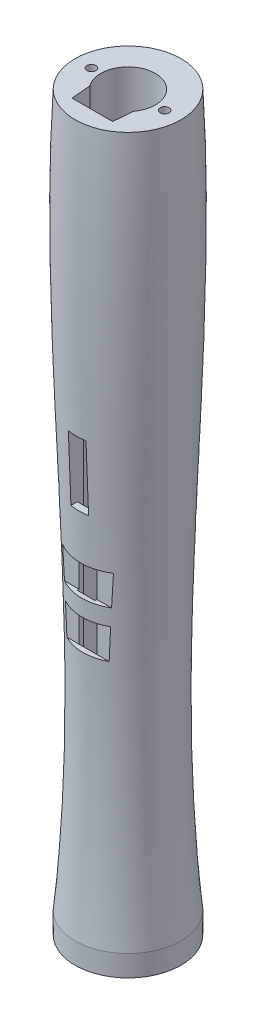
ISO-10303-21;
HEADER;
FILE_DESCRIPTION(('STEP AP214'),'2;1');
FILE_NAME('part.step','',(''),(''),'','','');
FILE_SCHEMA(('AUTOMOTIVE_DESIGN { 1 0 10303 214 1 1 1 1 }'));
ENDSEC;
DATA;
#1=APPLICATION_CONTEXT('core data for automotive mechanical design processes');
#2=APPLICATION_PROTOCOL_DEFINITION('international standard','automotive_design',2000,#1);
#3=PRODUCT_CONTEXT('',#1,'mechanical');
#4=PRODUCT('Part','Part','',(#3));
#5=PRODUCT_RELATED_PRODUCT_CATEGORY('part','',(#4));
#6=PRODUCT_DEFINITION_FORMATION('','',#4);
#7=PRODUCT_DEFINITION_CONTEXT('part definition',#1,'design');
#8=PRODUCT_DEFINITION('design','',#6,#7);
#9=PRODUCT_DEFINITION_SHAPE('','',#8);
#10=(LENGTH_UNIT() NAMED_UNIT(*) SI_UNIT(.MILLI.,.METRE.));
#11=(NAMED_UNIT(*) PLANE_ANGLE_UNIT() SI_UNIT($,.RADIAN.));
#12=(NAMED_UNIT(*) SI_UNIT($,.STERADIAN.) SOLID_ANGLE_UNIT());
#13=UNCERTAINTY_MEASURE_WITH_UNIT(LENGTH_MEASURE(1.E-05),#10,'distance_accuracy_value','');
#14=(GEOMETRIC_REPRESENTATION_CONTEXT(3) GLOBAL_UNCERTAINTY_ASSIGNED_CONTEXT((#13)) GLOBAL_UNIT_ASSIGNED_CONTEXT((#10,
#11,#12)) REPRESENTATION_CONTEXT('',''));
#15=CARTESIAN_POINT('',(0.,0.,0.));
#16=DIRECTION('',(0.,0.,1.));
#17=DIRECTION('',(1.,0.,0.));
#18=AXIS2_PLACEMENT_3D('',#15,#16,#17);
#19=CARTESIAN_POINT('',(0.,204.85,0.));
#20=DIRECTION('',(0.,-1.,0.));
#21=DIRECTION('',(0.,0.,-1.));
#22=AXIS2_PLACEMENT_3D('',#19,#20,#21);
#23=PLANE('',#22);
#24=CARTESIAN_POINT('',(-10.541,204.85,0.));
#25=DIRECTION('',(0.,1.,0.));
#26=DIRECTION('',(0.,0.,1.));
#27=AXIS2_PLACEMENT_3D('',#24,#25,#26);
#28=CIRCLE('',#27,1.28904999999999);
#29=CARTESIAN_POINT('',(-10.541,204.85,1.28904999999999));
#30=VERTEX_POINT('',#29);
#31=EDGE_CURVE('E209',#30,#30,#28,.T.);
#32=ORIENTED_EDGE('',*,*,#31,.F.);
#33=EDGE_LOOP('',(#32));
#34=FACE_BOUND('',#33,.T.);
#35=DIRECTION('',(-0.0861124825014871,0.,-0.996285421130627));
#36=VECTOR('',#35,1.);
#37=CARTESIAN_POINT('',(-6.731,204.85,0.));
#38=LINE('',#37,#36);
#39=CARTESIAN_POINT('',(-5.842,204.85,10.2853583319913));
#40=VERTEX_POINT('',#39);
#41=CARTESIAN_POINT('',(-6.32572865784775,204.85,4.68881999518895));
#42=VERTEX_POINT('',#41);
#43=EDGE_CURVE('E456',#40,#42,#38,.T.);
#44=ORIENTED_EDGE('',*,*,#43,.T.);
#45=CARTESIAN_POINT('',(0.,204.85,0.));
#46=DIRECTION('',(0.,1.,0.));
#47=DIRECTION('',(0.,0.,1.));
#48=AXIS2_PLACEMENT_3D('',#45,#46,#47);
#49=CIRCLE('',#48,7.874);
#50=CARTESIAN_POINT('',(6.32572865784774,204.85,4.68881999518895));
#51=VERTEX_POINT('',#50);
#52=EDGE_CURVE('E438',#51,#42,#49,.T.);
#53=ORIENTED_EDGE('',*,*,#52,.F.);
#54=DIRECTION('',(-0.0861124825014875,0.,0.996285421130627));
#55=VECTOR('',#54,1.);
#56=CARTESIAN_POINT('',(5.842,204.85,10.2853583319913));
#57=LINE('',#56,#55);
#58=CARTESIAN_POINT('',(5.842,204.85,10.2853583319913));
#59=VERTEX_POINT('',#58);
#60=EDGE_CURVE('E450',#51,#59,#57,.T.);
#61=ORIENTED_EDGE('',*,*,#60,.T.);
#62=DIRECTION('',(-1.,0.,0.));
#63=VECTOR('',#62,1.);
#64=CARTESIAN_POINT('',(-5.842,204.85,10.2853583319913));
#65=LINE('',#64,#63);
#66=EDGE_CURVE('E452',#59,#40,#65,.T.);
#67=ORIENTED_EDGE('',*,*,#66,.T.);
#68=EDGE_LOOP('',(#44,#53,#61,#67));
#69=FACE_BOUND('',#68,.T.);
#70=CARTESIAN_POINT('',(0.,204.85,0.));
#71=DIRECTION('',(0.,-1.,0.));
#72=DIRECTION('',(0.,0.,-1.));
#73=AXIS2_PLACEMENT_3D('',#70,#71,#72);
#74=CIRCLE('',#73,15.25);
#75=CARTESIAN_POINT('',(0.,204.85,-15.25));
#76=VERTEX_POINT('',#75);
#77=EDGE_CURVE('E474',#76,#76,#74,.T.);
#78=ORIENTED_EDGE('',*,*,#77,.F.);
#79=EDGE_LOOP('',(#78));
#80=FACE_BOUND('',#79,.T.);
#81=CARTESIAN_POINT('',(10.541,204.85,0.));
#82=DIRECTION('',(0.,1.,0.));
#83=DIRECTION('',(0.,0.,1.));
#84=AXIS2_PLACEMENT_3D('',#81,#82,#83);
#85=CIRCLE('',#84,1.28904999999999);
#86=CARTESIAN_POINT('',(10.541,204.85,1.28904999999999));
#87=VERTEX_POINT('',#86);
#88=EDGE_CURVE('E210',#87,#87,#85,.T.);
#89=ORIENTED_EDGE('',*,*,#88,.F.);
#90=EDGE_LOOP('',(#89));
#91=FACE_BOUND('',#90,.T.);
#92=ADVANCED_FACE('F34',(#34,#69,#80,#91),#23,.F.);
#93=CARTESIAN_POINT('',(-15.25,204.85,0.));
#94=CARTESIAN_POINT('',(-18.6607569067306,136.652495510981,0.));
#95=CARTESIAN_POINT('',(-8.44521283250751,68.0931069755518,0.));
#96=CARTESIAN_POINT('',(-15.25,0.,0.));
#97=B_SPLINE_CURVE_WITH_KNOTS('',3,(#93,#94,#95,#96),.UNSPECIFIED.,.F.,.F.,(4,4),(0.,1.),.UNSPECIFIED.);
#98=CARTESIAN_POINT('',(0.,0.,0.));
#99=DIRECTION('',(0.,-1.,0.));
#100=AXIS1_PLACEMENT('',#98,#99);
#101=SURFACE_OF_REVOLUTION('',#97,#100);
#102=CARTESIAN_POINT('',(0.,125.7,0.));
#103=DIRECTION('',(0.,-1.,0.));
#104=DIRECTION('',(0.,0.,-1.));
#105=AXIS2_PLACEMENT_3D('',#102,#103,#104);
#106=CIRCLE('',#105,14.8690766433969);
#107=CARTESIAN_POINT('',(-2.538,125.7,14.6508701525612));
#108=VERTEX_POINT('',#107);
#109=CARTESIAN_POINT('',(2.542,125.7,14.6501766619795));
#110=VERTEX_POINT('',#109);
#111=EDGE_CURVE('E407',#108,#110,#106,.F.);
#112=ORIENTED_EDGE('',*,*,#111,.T.);
#113=CARTESIAN_POINT('',(2.54200000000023,125.7,14.6501766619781));
#114=CARTESIAN_POINT('',(2.54200000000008,124.116594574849,14.5903733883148));
#115=CARTESIAN_POINT('',(2.54200000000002,122.533226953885,14.5295881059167));
#116=CARTESIAN_POINT('',(2.54199999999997,119.366538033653,14.4068231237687));
#117=CARTESIAN_POINT('',(2.54199999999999,117.783216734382,14.3448434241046));
#118=CARTESIAN_POINT('',(2.542,114.61659004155,14.2204591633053));
#119=CARTESIAN_POINT('',(2.542,113.033284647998,14.1580546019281));
#120=CARTESIAN_POINT('',(2.542,109.866660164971,14.0335917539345));
#121=CARTESIAN_POINT('',(2.54199999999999,108.283341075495,13.971533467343));
#122=CARTESIAN_POINT('',(2.542,106.7,13.9100338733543));
#123=B_SPLINE_CURVE_WITH_KNOTS('',3,(#113,#114,#115,#116,#117,#118,#119,#120,#121,#122),
.UNSPECIFIED.,.F.,.F.,(4,2,2,2,4),(0.,4.7536018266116,9.50720331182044,14.2608075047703,
19.0144120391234),.UNSPECIFIED.);
#124=CARTESIAN_POINT('',(2.542,106.7,13.9100338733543));
#125=VERTEX_POINT('',#124);
#126=EDGE_CURVE('E424',#110,#125,#123,.T.);
#127=ORIENTED_EDGE('',*,*,#126,.T.);
#128=CARTESIAN_POINT('',(0.,106.7,0.));
#129=DIRECTION('',(0.,-1.,0.));
#130=DIRECTION('',(0.,0.,-1.));
#131=AXIS2_PLACEMENT_3D('',#128,#129,#130);
#132=CIRCLE('',#131,14.14039625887);
#133=CARTESIAN_POINT('',(-2.538,106.7,13.9107642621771));
#134=VERTEX_POINT('',#133);
#135=EDGE_CURVE('E387',#125,#134,#132,.T.);
#136=ORIENTED_EDGE('',*,*,#135,.T.);
#137=CARTESIAN_POINT('',(-2.538,106.7,13.9107642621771));
#138=CARTESIAN_POINT('',(-2.538,108.283340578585,13.9722606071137));
#139=CARTESIAN_POINT('',(-2.538,109.866659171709,14.0343156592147));
#140=CARTESIAN_POINT('',(-2.538,113.033282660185,14.1587721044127));
#141=CARTESIAN_POINT('',(-2.538,114.616587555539,14.2211734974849));
#142=CARTESIAN_POINT('',(-2.538,117.783214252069,14.3455515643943));
#143=CARTESIAN_POINT('',(-2.538,119.366536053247,14.4075282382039));
#144=CARTESIAN_POINT('',(-2.538,122.533225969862,14.5302873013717));
#145=CARTESIAN_POINT('',(-2.538,124.116594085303,14.5910696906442));
#146=CARTESIAN_POINT('',(-2.538,125.7,14.6508701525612));
#147=B_SPLINE_CURVE_WITH_KNOTS('',3,(#137,#138,#139,#140,#141,#142,#143,#144,#145,#146),
.UNSPECIFIED.,.F.,.F.,(4,2,2,2,4),(0.,4.75360266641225,9.50720499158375,14.2608076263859,
19.0144106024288),.UNSPECIFIED.);
#148=EDGE_CURVE('E400',#134,#108,#147,.T.);
#149=ORIENTED_EDGE('',*,*,#148,.T.);
#150=EDGE_LOOP('',(#112,#127,#136,#149));
#151=FACE_BOUND('',#150,.T.);
#152=CARTESIAN_POINT('',(0.,0.,0.));
#153=DIRECTION('',(0.,1.,0.));
#154=DIRECTION('',(0.,0.,-1.));
#155=AXIS2_PLACEMENT_3D('',#152,#153,#154);
#156=CIRCLE('',#155,15.25);
#157=CARTESIAN_POINT('',(0.,0.,-15.25));
#158=VERTEX_POINT('',#157);
#159=EDGE_CURVE('E480',#158,#158,#156,.F.);
#160=ORIENTED_EDGE('',*,*,#159,.F.);
#161=EDGE_LOOP('',(#160));
#162=FACE_BOUND('',#161,.T.);
#163=ORIENTED_EDGE('',*,*,#77,.T.);
#164=EDGE_LOOP('',(#163));
#165=FACE_BOUND('',#164,.T.);
#166=CARTESIAN_POINT('',(0.,84.59,0.));
#167=DIRECTION('',(0.,-1.,0.));
#168=DIRECTION('',(0.,0.,-1.));
#169=AXIS2_PLACEMENT_3D('',#166,#167,#168);
#170=CIRCLE('',#169,13.3706468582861);
#171=CARTESIAN_POINT('',(6.7777173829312,84.59,11.5254823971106));
#172=VERTEX_POINT('',#171);
#173=CARTESIAN_POINT('',(-6.7777173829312,84.59,11.5254823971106));
#174=VERTEX_POINT('',#173);
#175=EDGE_CURVE('E430',#172,#174,#170,.T.);
#176=ORIENTED_EDGE('',*,*,#175,.T.);
#177=CARTESIAN_POINT('',(-7.32632067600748,93.49,11.5254823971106));
#178=CARTESIAN_POINT('',(-7.29464869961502,92.9956293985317,11.5254823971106));
#179=CARTESIAN_POINT('',(-7.26312403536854,92.5012493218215,11.5254823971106));
#180=CARTESIAN_POINT('',(-7.20041993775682,91.512468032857,11.5254823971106));
#181=CARTESIAN_POINT('',(-7.16924050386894,91.0180668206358,11.5254823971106));
#182=CARTESIAN_POINT('',(-7.10727740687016,90.0292400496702,11.5254823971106));
#183=CARTESIAN_POINT('',(-7.07649374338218,89.5348144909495,11.5254823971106));
#184=CARTESIAN_POINT('',(-7.01537536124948,88.5459354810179,11.5254823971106));
#185=CARTESIAN_POINT('',(-6.98504064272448,88.0514820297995,11.5254823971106));
#186=CARTESIAN_POINT('',(-6.92487520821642,87.0625440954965,11.5254823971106));
#187=CARTESIAN_POINT('',(-6.89504449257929,86.5680596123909,11.5254823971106));
#188=CARTESIAN_POINT('',(-6.83594498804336,85.5790561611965,11.5254823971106));
#189=CARTESIAN_POINT('',(-6.80667620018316,85.0845371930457,11.5254823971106));
#190=CARTESIAN_POINT('',(-6.77771738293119,84.59,11.5254823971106));
#191=B_SPLINE_CURVE_WITH_KNOTS('',3,(#177,#178,#179,#180,#181,#182,#183,#184,#185,#186,#187,
#188,#189,#190),.UNSPECIFIED.,.F.,.F.,(4,2,2,2,2,2,4),(0.,1.48615233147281,2.97230241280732,
4.45845107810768,5.94460013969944,7.43075022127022,8.91690304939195),.UNSPECIFIED.);
#192=CARTESIAN_POINT('',(-7.32632067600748,93.49,11.5254823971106));
#193=VERTEX_POINT('',#192);
#194=EDGE_CURVE('E288',#193,#174,#191,.T.);
#195=ORIENTED_EDGE('',*,*,#194,.F.);
#196=CARTESIAN_POINT('',(0.,93.49,0.));
#197=DIRECTION('',(0.,-1.,0.));
#198=DIRECTION('',(0.,0.,-1.));
#199=AXIS2_PLACEMENT_3D('',#196,#197,#198);
#200=CIRCLE('',#199,13.656929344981);
#201=CARTESIAN_POINT('',(7.32632067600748,93.49,11.5254823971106));
#202=VERTEX_POINT('',#201);
#203=EDGE_CURVE('E432',#193,#202,#200,.F.);
#204=ORIENTED_EDGE('',*,*,#203,.T.);
#205=CARTESIAN_POINT('',(6.77771738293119,84.59,11.5254823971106));
#206=CARTESIAN_POINT('',(6.80667620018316,85.0845371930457,11.5254823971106));
#207=CARTESIAN_POINT('',(6.83594498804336,85.5790561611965,11.5254823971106));
#208=CARTESIAN_POINT('',(6.89504449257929,86.5680596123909,11.5254823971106));
#209=CARTESIAN_POINT('',(6.92487520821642,87.0625440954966,11.5254823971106));
#210=CARTESIAN_POINT('',(6.98504064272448,88.0514820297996,11.5254823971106));
#211=CARTESIAN_POINT('',(7.01537536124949,88.5459354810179,11.5254823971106));
#212=CARTESIAN_POINT('',(7.07649374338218,89.5348144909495,11.5254823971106));
#213=CARTESIAN_POINT('',(7.10727740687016,90.0292400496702,11.5254823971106));
#214=CARTESIAN_POINT('',(7.16924050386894,91.0180668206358,11.5254823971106));
#215=CARTESIAN_POINT('',(7.20041993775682,91.512468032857,11.5254823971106));
#216=CARTESIAN_POINT('',(7.26312403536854,92.5012493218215,11.5254823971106));
#217=CARTESIAN_POINT('',(7.29464869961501,92.9956293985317,11.5254823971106));
#218=CARTESIAN_POINT('',(7.32632067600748,93.49,11.5254823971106));
#219=B_SPLINE_CURVE_WITH_KNOTS('',3,(#205,#206,#207,#208,#209,#210,#211,#212,#213,#214,#215,
#216,#217,#218),.UNSPECIFIED.,.F.,.F.,(4,2,2,2,2,2,4),(0.,1.48615282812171,2.97230290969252,
4.45845197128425,5.94460063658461,7.43075071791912,8.91690304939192),.UNSPECIFIED.);
#220=EDGE_CURVE('E293',#172,#202,#219,.T.);
#221=ORIENTED_EDGE('',*,*,#220,.F.);
#222=EDGE_LOOP('',(#176,#195,#204,#221));
#223=FACE_BOUND('',#222,.T.);
#224=CARTESIAN_POINT('',(0.,70.86,0.));
#225=DIRECTION('',(0.,-1.,0.));
#226=DIRECTION('',(0.,0.,-1.));
#227=AXIS2_PLACEMENT_3D('',#224,#225,#226);
#228=CIRCLE('',#227,13.0308951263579);
#229=CARTESIAN_POINT('',(6.08008908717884,70.86,11.5254823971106));
#230=VERTEX_POINT('',#229);
#231=CARTESIAN_POINT('',(-6.08008908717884,70.86,11.5254823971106));
#232=VERTEX_POINT('',#231);
#233=EDGE_CURVE('E434',#230,#232,#228,.T.);
#234=ORIENTED_EDGE('',*,*,#233,.T.);
#235=CARTESIAN_POINT('',(-6.50588851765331,79.76,11.5254823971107));
#236=CARTESIAN_POINT('',(-6.47930983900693,79.2656973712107,11.5254823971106));
#237=CARTESIAN_POINT('',(-6.45314593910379,78.771372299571,11.5254823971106));
#238=CARTESIAN_POINT('',(-6.40171921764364,77.7826795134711,11.5254823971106));
#239=CARTESIAN_POINT('',(-6.37645638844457,77.2883117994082,11.5254823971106));
#240=CARTESIAN_POINT('',(-6.32690299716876,76.299530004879,11.5254823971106));
#241=CARTESIAN_POINT('',(-6.30261243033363,75.8051159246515,11.5254823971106));
#242=CARTESIAN_POINT('',(-6.25507742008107,74.8162370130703,11.5254823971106));
#243=CARTESIAN_POINT('',(-6.2318329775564,74.3217721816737,11.5254823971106));
#244=CARTESIAN_POINT('',(-6.18646581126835,73.3327889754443,11.5254823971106));
#245=CARTESIAN_POINT('',(-6.16434309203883,72.8382706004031,11.5254823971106));
#246=CARTESIAN_POINT('',(-6.12129703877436,71.8491769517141,11.5254823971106));
#247=CARTESIAN_POINT('',(-6.10037371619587,71.3546016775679,11.5254823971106));
#248=CARTESIAN_POINT('',(-6.08008908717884,70.86,11.5254823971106));
#249=B_SPLINE_CURVE_WITH_KNOTS('',3,(#235,#236,#237,#238,#239,#240,#241,#242,#243,#244,#245,
#246,#247,#248),.UNSPECIFIED.,.F.,.F.,(4,2,2,2,2,2,4),(0.,1.48505007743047,2.97008755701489,
4.45511776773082,5.94014924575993,7.42518672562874,8.91023838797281),.UNSPECIFIED.);
#250=CARTESIAN_POINT('',(-6.50588851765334,79.76,11.5254823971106));
#251=VERTEX_POINT('',#250);
#252=EDGE_CURVE('E250',#251,#232,#249,.T.);
#253=ORIENTED_EDGE('',*,*,#252,.F.);
#254=CARTESIAN_POINT('',(0.,79.76,0.));
#255=DIRECTION('',(0.,-1.,0.));
#256=DIRECTION('',(0.,0.,-1.));
#257=AXIS2_PLACEMENT_3D('',#254,#255,#256);
#258=CIRCLE('',#257,13.23492840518);
#259=CARTESIAN_POINT('',(6.50588851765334,79.76,11.5254823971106));
#260=VERTEX_POINT('',#259);
#261=EDGE_CURVE('E436',#251,#260,#258,.F.);
#262=ORIENTED_EDGE('',*,*,#261,.T.);
#263=CARTESIAN_POINT('',(6.08008908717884,70.86,11.5254823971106));
#264=CARTESIAN_POINT('',(6.10037371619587,71.3546016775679,11.5254823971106));
#265=CARTESIAN_POINT('',(6.12129703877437,71.8491769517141,11.5254823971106));
#266=CARTESIAN_POINT('',(6.16434309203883,72.8382706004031,11.5254823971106));
#267=CARTESIAN_POINT('',(6.18646581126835,73.3327889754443,11.5254823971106));
#268=CARTESIAN_POINT('',(6.23183297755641,74.3217721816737,11.5254823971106));
#269=CARTESIAN_POINT('',(6.25507742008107,74.8162370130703,11.5254823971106));
#270=CARTESIAN_POINT('',(6.30261243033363,75.8051159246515,11.5254823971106));
#271=CARTESIAN_POINT('',(6.32690299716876,76.299530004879,11.5254823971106));
#272=CARTESIAN_POINT('',(6.37645638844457,77.2883117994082,11.5254823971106));
#273=CARTESIAN_POINT('',(6.40171921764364,77.7826795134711,11.5254823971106));
#274=CARTESIAN_POINT('',(6.45314593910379,78.771372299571,11.5254823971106));
#275=CARTESIAN_POINT('',(6.47930983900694,79.2656973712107,11.5254823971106));
#276=CARTESIAN_POINT('',(6.50588851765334,79.76,11.5254823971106));
#277=B_SPLINE_CURVE_WITH_KNOTS('',3,(#263,#264,#265,#266,#267,#268,#269,#270,#271,#272,#273,
#274,#275,#276),.UNSPECIFIED.,.F.,.F.,(4,2,2,2,2,2,4),(0.,1.48505166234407,2.97008914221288,
4.45512062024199,5.94015083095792,7.42518831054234,8.91023838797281),.UNSPECIFIED.);
#278=EDGE_CURVE('E258',#230,#260,#277,.T.);
#279=ORIENTED_EDGE('',*,*,#278,.F.);
#280=EDGE_LOOP('',(#234,#253,#262,#279));
#281=FACE_BOUND('',#280,.T.);
#282=ADVANCED_FACE('F263',(#151,#162,#165,#223,#281),#101,.T.);
#283=CARTESIAN_POINT('',(2.542,70.86,20.2853583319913));
#284=DIRECTION('',(1.,0.,0.));
#285=DIRECTION('',(0.,0.,-1.));
#286=AXIS2_PLACEMENT_3D('',#283,#284,#285);
#287=PLANE('',#286);
#288=DIRECTION('',(0.,-1.,0.));
#289=VECTOR('',#288,1.);
#290=CARTESIAN_POINT('',(2.542,70.86,11.5254823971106));
#291=LINE('',#290,#289);
#292=CARTESIAN_POINT('',(2.542,79.76,11.5254823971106));
#293=VERTEX_POINT('',#292);
#294=CARTESIAN_POINT('',(2.542,70.86,11.5254823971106));
#295=VERTEX_POINT('',#294);
#296=EDGE_CURVE('E248',#293,#295,#291,.T.);
#297=ORIENTED_EDGE('',*,*,#296,.F.);
#298=DIRECTION('',(0.,0.,-1.));
#299=VECTOR('',#298,1.);
#300=CARTESIAN_POINT('',(2.542,79.76,20.2853583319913));
#301=LINE('',#300,#299);
#302=CARTESIAN_POINT('',(2.542,79.76,12.0653583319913));
#303=VERTEX_POINT('',#302);
#304=EDGE_CURVE('E56',#303,#293,#301,.T.);
#305=ORIENTED_EDGE('',*,*,#304,.F.);
#306=DIRECTION('',(0.,-1.,0.));
#307=VECTOR('',#306,1.);
#308=CARTESIAN_POINT('',(2.542,114.989568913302,12.0653583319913));
#309=LINE('',#308,#307);
#310=CARTESIAN_POINT('',(2.542,84.59,12.0653583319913));
#311=VERTEX_POINT('',#310);
#312=EDGE_CURVE('E307',#311,#303,#309,.T.);
#313=ORIENTED_EDGE('',*,*,#312,.F.);
#314=DIRECTION('',(0.,0.,1.));
#315=VECTOR('',#314,1.);
#316=CARTESIAN_POINT('',(2.542,84.59,20.2853583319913));
#317=LINE('',#316,#315);
#318=CARTESIAN_POINT('',(2.542,84.59,11.5254823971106));
#319=VERTEX_POINT('',#318);
#320=EDGE_CURVE('E241',#319,#311,#317,.T.);
#321=ORIENTED_EDGE('',*,*,#320,.F.);
#322=DIRECTION('',(0.,-1.,0.));
#323=VECTOR('',#322,1.);
#324=CARTESIAN_POINT('',(2.542,70.86,11.5254823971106));
#325=LINE('',#324,#323);
#326=CARTESIAN_POINT('',(2.542,93.49,11.5254823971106));
#327=VERTEX_POINT('',#326);
#328=EDGE_CURVE('E853',#327,#319,#325,.T.);
#329=ORIENTED_EDGE('',*,*,#328,.F.);
#330=DIRECTION('',(0.,0.,-1.));
#331=VECTOR('',#330,1.);
#332=CARTESIAN_POINT('',(2.542,93.49,20.2853583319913));
#333=LINE('',#332,#331);
#334=CARTESIAN_POINT('',(2.542,93.49,12.0653583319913));
#335=VERTEX_POINT('',#334);
#336=EDGE_CURVE('E49',#335,#327,#333,.T.);
#337=ORIENTED_EDGE('',*,*,#336,.F.);
#338=CARTESIAN_POINT('',(2.542,106.7,12.0653583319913));
#339=VERTEX_POINT('',#338);
#340=EDGE_CURVE('E366',#339,#335,#309,.T.);
#341=ORIENTED_EDGE('',*,*,#340,.F.);
#342=DIRECTION('',(0.,0.,-1.));
#343=VECTOR('',#342,1.);
#344=CARTESIAN_POINT('',(2.542,106.7,20.2853583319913));
#345=LINE('',#344,#343);
#346=EDGE_CURVE('E381',#125,#339,#345,.T.);
#347=ORIENTED_EDGE('',*,*,#346,.F.);
#348=ORIENTED_EDGE('',*,*,#126,.F.);
#349=DIRECTION('',(0.,0.,-1.));
#350=VECTOR('',#349,1.);
#351=CARTESIAN_POINT('',(2.542,125.7,20.2853583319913));
#352=LINE('',#351,#350);
#353=CARTESIAN_POINT('',(2.542,125.7,11.5254823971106));
#354=VERTEX_POINT('',#353);
#355=EDGE_CURVE('E385',#110,#354,#352,.T.);
#356=ORIENTED_EDGE('',*,*,#355,.T.);
#357=DIRECTION('',(0.,-0.992546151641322,0.121869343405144));
#358=VECTOR('',#357,1.);
#359=CARTESIAN_POINT('',(2.542,105.922587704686,13.9538432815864));
#360=LINE('',#359,#358);
#361=CARTESIAN_POINT('',(2.542,135.8,10.2853583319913));
#362=VERTEX_POINT('',#361);
#363=EDGE_CURVE('E504',#354,#362,#360,.F.);
#364=ORIENTED_EDGE('',*,*,#363,.T.);
#365=DIRECTION('',(0.,-1.,0.));
#366=VECTOR('',#365,1.);
#367=CARTESIAN_POINT('',(2.542,70.86,10.2853583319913));
#368=LINE('',#367,#366);
#369=CARTESIAN_POINT('',(2.542,60.7599999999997,10.2853583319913));
#370=VERTEX_POINT('',#369);
#371=EDGE_CURVE('E382',#362,#370,#368,.T.);
#372=ORIENTED_EDGE('',*,*,#371,.T.);
#373=DIRECTION('',(0.,-0.992546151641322,-0.121869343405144));
#374=VECTOR('',#373,1.);
#375=CARTESIAN_POINT('',(2.542,71.9196028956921,11.6555852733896));
#376=LINE('',#375,#374);
#377=EDGE_CURVE('E501',#370,#295,#376,.F.);
#378=ORIENTED_EDGE('',*,*,#377,.T.);
#379=EDGE_LOOP('',(#297,#305,#313,#321,#329,#337,#341,#347,#348,#356,#364,#372,#378));
#380=FACE_BOUND('',#379,.T.);
#381=ADVANCED_FACE('F536',(#380),#287,.F.);
#382=CARTESIAN_POINT('',(-2.538,70.86,20.2853583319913));
#383=DIRECTION('',(-1.,0.,0.));
#384=DIRECTION('',(0.,0.,1.));
#385=AXIS2_PLACEMENT_3D('',#382,#383,#384);
#386=PLANE('',#385);
#387=DIRECTION('',(0.,1.,0.));
#388=VECTOR('',#387,1.);
#389=CARTESIAN_POINT('',(-2.538,70.86,11.5254823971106));
#390=LINE('',#389,#388);
#391=CARTESIAN_POINT('',(-2.538,70.86,11.5254823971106));
#392=VERTEX_POINT('',#391);
#393=CARTESIAN_POINT('',(-2.538,79.76,11.5254823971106));
#394=VERTEX_POINT('',#393);
#395=EDGE_CURVE('E245',#392,#394,#390,.T.);
#396=ORIENTED_EDGE('',*,*,#395,.F.);
#397=DIRECTION('',(0.,0.992546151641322,0.121869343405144));
#398=VECTOR('',#397,1.);
#399=CARTESIAN_POINT('',(-2.538,71.9196028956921,11.6555852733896));
#400=LINE('',#399,#398);
#401=CARTESIAN_POINT('',(-2.538,60.7599999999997,10.2853583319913));
#402=VERTEX_POINT('',#401);
#403=EDGE_CURVE('E498',#392,#402,#400,.F.);
#404=ORIENTED_EDGE('',*,*,#403,.T.);
#405=DIRECTION('',(0.,1.,0.));
#406=VECTOR('',#405,1.);
#407=CARTESIAN_POINT('',(-2.538,70.86,10.2853583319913));
#408=LINE('',#407,#406);
#409=CARTESIAN_POINT('',(-2.538,135.8,10.2853583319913));
#410=VERTEX_POINT('',#409);
#411=EDGE_CURVE('E384',#402,#410,#408,.T.);
#412=ORIENTED_EDGE('',*,*,#411,.T.);
#413=DIRECTION('',(0.,0.992546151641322,-0.121869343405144));
#414=VECTOR('',#413,1.);
#415=CARTESIAN_POINT('',(-2.538,105.922587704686,13.9538432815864));
#416=LINE('',#415,#414);
#417=CARTESIAN_POINT('',(-2.538,125.7,11.5254823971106));
#418=VERTEX_POINT('',#417);
#419=EDGE_CURVE('E42',#410,#418,#416,.F.);
#420=ORIENTED_EDGE('',*,*,#419,.T.);
#421=DIRECTION('',(0.,0.,-1.));
#422=VECTOR('',#421,1.);
#423=CARTESIAN_POINT('',(-2.538,125.7,20.2853583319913));
#424=LINE('',#423,#422);
#425=EDGE_CURVE('E390',#108,#418,#424,.T.);
#426=ORIENTED_EDGE('',*,*,#425,.F.);
#427=ORIENTED_EDGE('',*,*,#148,.F.);
#428=DIRECTION('',(0.,0.,-1.));
#429=VECTOR('',#428,1.);
#430=CARTESIAN_POINT('',(-2.538,106.7,20.2853583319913));
#431=LINE('',#430,#429);
#432=CARTESIAN_POINT('',(-2.538,106.7,12.0653583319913));
#433=VERTEX_POINT('',#432);
#434=EDGE_CURVE('E393',#134,#433,#431,.T.);
#435=ORIENTED_EDGE('',*,*,#434,.T.);
#436=DIRECTION('',(0.,1.,0.));
#437=VECTOR('',#436,1.);
#438=CARTESIAN_POINT('',(-2.538,114.989568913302,12.0653583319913));
#439=LINE('',#438,#437);
#440=CARTESIAN_POINT('',(-2.538,93.49,12.0653583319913));
#441=VERTEX_POINT('',#440);
#442=EDGE_CURVE('E367',#441,#433,#439,.T.);
#443=ORIENTED_EDGE('',*,*,#442,.F.);
#444=DIRECTION('',(0.,0.,1.));
#445=VECTOR('',#444,1.);
#446=CARTESIAN_POINT('',(-2.538,93.49,20.2853583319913));
#447=LINE('',#446,#445);
#448=CARTESIAN_POINT('',(-2.538,93.49,11.5254823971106));
#449=VERTEX_POINT('',#448);
#450=EDGE_CURVE('E236',#449,#441,#447,.T.);
#451=ORIENTED_EDGE('',*,*,#450,.F.);
#452=DIRECTION('',(0.,1.,0.));
#453=VECTOR('',#452,1.);
#454=CARTESIAN_POINT('',(-2.538,70.86,11.5254823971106));
#455=LINE('',#454,#453);
#456=CARTESIAN_POINT('',(-2.538,84.59,11.5254823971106));
#457=VERTEX_POINT('',#456);
#458=EDGE_CURVE('E11',#457,#449,#455,.T.);
#459=ORIENTED_EDGE('',*,*,#458,.F.);
#460=DIRECTION('',(0.,0.,-1.));
#461=VECTOR('',#460,1.);
#462=CARTESIAN_POINT('',(-2.538,84.59,20.2853583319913));
#463=LINE('',#462,#461);
#464=CARTESIAN_POINT('',(-2.538,84.59,12.0653583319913));
#465=VERTEX_POINT('',#464);
#466=EDGE_CURVE('E238',#465,#457,#463,.T.);
#467=ORIENTED_EDGE('',*,*,#466,.F.);
#468=CARTESIAN_POINT('',(-2.538,79.76,12.0653583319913));
#469=VERTEX_POINT('',#468);
#470=EDGE_CURVE('E369',#469,#465,#439,.T.);
#471=ORIENTED_EDGE('',*,*,#470,.F.);
#472=DIRECTION('',(0.,0.,1.));
#473=VECTOR('',#472,1.);
#474=CARTESIAN_POINT('',(-2.538,79.76,20.2853583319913));
#475=LINE('',#474,#473);
#476=EDGE_CURVE('E243',#394,#469,#475,.T.);
#477=ORIENTED_EDGE('',*,*,#476,.F.);
#478=EDGE_LOOP('',(#396,#404,#412,#420,#426,#427,#435,#443,#451,#459,#467,#471,#477));
#479=FACE_BOUND('',#478,.T.);
#480=ADVANCED_FACE('F418',(#479),#386,.F.);
#481=CARTESIAN_POINT('',(2.542,106.7,20.2853583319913));
#482=DIRECTION('',(0.,-1.,0.));
#483=DIRECTION('',(0.,0.,-1.));
#484=AXIS2_PLACEMENT_3D('',#481,#482,#483);
#485=PLANE('',#484);
#486=DIRECTION('',(1.,0.,0.));
#487=VECTOR('',#486,1.);
#488=CARTESIAN_POINT('',(2.542,106.7,12.0653583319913));
#489=LINE('',#488,#487);
#490=EDGE_CURVE('E379',#433,#339,#489,.T.);
#491=ORIENTED_EDGE('',*,*,#490,.F.);
#492=ORIENTED_EDGE('',*,*,#434,.F.);
#493=ORIENTED_EDGE('',*,*,#135,.F.);
#494=ORIENTED_EDGE('',*,*,#346,.T.);
#495=EDGE_LOOP('',(#491,#492,#493,#494));
#496=FACE_BOUND('',#495,.T.);
#497=ADVANCED_FACE('F414',(#496),#485,.F.);
#498=CARTESIAN_POINT('',(2.542,93.49,20.2853583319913));
#499=DIRECTION('',(0.,1.,0.));
#500=DIRECTION('',(0.,0.,1.));
#501=AXIS2_PLACEMENT_3D('',#498,#499,#500);
#502=PLANE('',#501);
#503=DIRECTION('',(-1.,0.,0.));
#504=VECTOR('',#503,1.);
#505=CARTESIAN_POINT('',(2.542,93.49,12.0653583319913));
#506=LINE('',#505,#504);
#507=EDGE_CURVE('E376',#335,#441,#506,.T.);
#508=ORIENTED_EDGE('',*,*,#507,.F.);
#509=ORIENTED_EDGE('',*,*,#336,.T.);
#510=DIRECTION('',(1.,0.,0.));
#511=VECTOR('',#510,1.);
#512=CARTESIAN_POINT('',(-17.458,93.49,11.5254823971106));
#513=LINE('',#512,#511);
#514=EDGE_CURVE('E220',#327,#202,#513,.T.);
#515=ORIENTED_EDGE('',*,*,#514,.T.);
#516=ORIENTED_EDGE('',*,*,#203,.F.);
#517=EDGE_CURVE('E232',#193,#449,#513,.T.);
#518=ORIENTED_EDGE('',*,*,#517,.T.);
#519=ORIENTED_EDGE('',*,*,#450,.T.);
#520=EDGE_LOOP('',(#508,#509,#515,#516,#518,#519));
#521=FACE_BOUND('',#520,.T.);
#522=ADVANCED_FACE('F417',(#521),#502,.F.);
#523=CARTESIAN_POINT('',(2.542,84.59,20.2853583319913));
#524=DIRECTION('',(0.,-1.,0.));
#525=DIRECTION('',(0.,0.,-1.));
#526=AXIS2_PLACEMENT_3D('',#523,#524,#525);
#527=PLANE('',#526);
#528=DIRECTION('',(1.,0.,0.));
#529=VECTOR('',#528,1.);
#530=CARTESIAN_POINT('',(2.542,84.59,12.0653583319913));
#531=LINE('',#530,#529);
#532=EDGE_CURVE('E373',#465,#311,#531,.T.);
#533=ORIENTED_EDGE('',*,*,#532,.F.);
#534=ORIENTED_EDGE('',*,*,#466,.T.);
#535=DIRECTION('',(1.,0.,0.));
#536=VECTOR('',#535,1.);
#537=CARTESIAN_POINT('',(-17.458,84.59,11.5254823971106));
#538=LINE('',#537,#536);
#539=EDGE_CURVE('E225',#174,#457,#538,.T.);
#540=ORIENTED_EDGE('',*,*,#539,.F.);
#541=ORIENTED_EDGE('',*,*,#175,.F.);
#542=EDGE_CURVE('E233',#319,#172,#538,.T.);
#543=ORIENTED_EDGE('',*,*,#542,.F.);
#544=ORIENTED_EDGE('',*,*,#320,.T.);
#545=EDGE_LOOP('',(#533,#534,#540,#541,#543,#544));
#546=FACE_BOUND('',#545,.T.);
#547=ADVANCED_FACE('F688',(#546),#527,.F.);
#548=CARTESIAN_POINT('',(2.542,79.76,20.2853583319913));
#549=DIRECTION('',(0.,1.,0.));
#550=DIRECTION('',(0.,0.,1.));
#551=AXIS2_PLACEMENT_3D('',#548,#549,#550);
#552=PLANE('',#551);
#553=DIRECTION('',(-1.,0.,0.));
#554=VECTOR('',#553,1.);
#555=CARTESIAN_POINT('',(2.542,79.76,12.0653583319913));
#556=LINE('',#555,#554);
#557=EDGE_CURVE('E370',#303,#469,#556,.T.);
#558=ORIENTED_EDGE('',*,*,#557,.F.);
#559=ORIENTED_EDGE('',*,*,#304,.T.);
#560=DIRECTION('',(1.,0.,0.));
#561=VECTOR('',#560,1.);
#562=CARTESIAN_POINT('',(-17.458,79.76,11.5254823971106));
#563=LINE('',#562,#561);
#564=EDGE_CURVE('E221',#293,#260,#563,.T.);
#565=ORIENTED_EDGE('',*,*,#564,.T.);
#566=ORIENTED_EDGE('',*,*,#261,.F.);
#567=EDGE_CURVE('E224',#251,#394,#563,.T.);
#568=ORIENTED_EDGE('',*,*,#567,.T.);
#569=ORIENTED_EDGE('',*,*,#476,.T.);
#570=EDGE_LOOP('',(#558,#559,#565,#566,#568,#569));
#571=FACE_BOUND('',#570,.T.);
#572=ADVANCED_FACE('F527',(#571),#552,.F.);
#573=CARTESIAN_POINT('',(0.,204.85,0.));
#574=DIRECTION('',(0.,-1.,0.));
#575=DIRECTION('',(0.,0.,-1.));
#576=AXIS2_PLACEMENT_3D('',#573,#574,#575);
#577=CYLINDRICAL_SURFACE('',#576,6.731);
#578=CARTESIAN_POINT('',(0.,150.75,0.));
#579=DIRECTION('',(0.,1.,0.));
#580=DIRECTION('',(0.,0.,1.));
#581=AXIS2_PLACEMENT_3D('',#578,#579,#580);
#582=CIRCLE('',#581,6.731);
#583=CARTESIAN_POINT('',(-6.731,150.75,0.));
#584=VERTEX_POINT('',#583);
#585=CARTESIAN_POINT('',(6.731,150.75,0.));
#586=VERTEX_POINT('',#585);
#587=EDGE_CURVE('E442',#584,#586,#582,.F.);
#588=ORIENTED_EDGE('',*,*,#587,.F.);
#589=DIRECTION('',(0.,-1.,0.));
#590=VECTOR('',#589,1.);
#591=CARTESIAN_POINT('',(-6.731,204.85,0.));
#592=LINE('',#591,#590);
#593=CARTESIAN_POINT('',(-6.73024605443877,0.,0.00584624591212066));
#594=VERTEX_POINT('',#593);
#595=EDGE_CURVE('E467',#584,#594,#592,.T.);
#596=ORIENTED_EDGE('',*,*,#595,.T.);
#597=CARTESIAN_POINT('',(0.,1.11022302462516E-13,0.));
#598=DIRECTION('',(0.,-1.,0.));
#599=DIRECTION('',(-1.,0.,0.));
#600=AXIS2_PLACEMENT_3D('',#597,#598,#599);
#601=CIRCLE('',#600,6.731);
#602=CARTESIAN_POINT('',(6.7302463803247,0.,0.00584370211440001));
#603=VERTEX_POINT('',#602);
#604=EDGE_CURVE('E363',#594,#603,#601,.T.);
#605=ORIENTED_EDGE('',*,*,#604,.T.);
#606=DIRECTION('',(0.,-1.,0.));
#607=VECTOR('',#606,1.);
#608=CARTESIAN_POINT('',(6.731,204.85,0.));
#609=LINE('',#608,#607);
#610=EDGE_CURVE('E459',#586,#603,#609,.T.);
#611=ORIENTED_EDGE('',*,*,#610,.F.);
#612=EDGE_LOOP('',(#588,#596,#605,#611));
#613=FACE_BOUND('',#612,.T.);
#614=ADVANCED_FACE('F517',(#613),#577,.F.);
#615=CARTESIAN_POINT('',(-6.731,204.85,0.));
#616=DIRECTION('',(-0.996285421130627,0.,0.086112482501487));
#617=DIRECTION('',(0.0861124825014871,0.,0.996285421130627));
#618=AXIS2_PLACEMENT_3D('',#615,#616,#617);
#619=PLANE('',#618);
#620=DIRECTION('',(-0.0861124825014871,0.,-0.996285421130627));
#621=VECTOR('',#620,1.);
#622=CARTESIAN_POINT('',(-6.731,150.75,0.));
#623=LINE('',#622,#621);
#624=CARTESIAN_POINT('',(-6.32572865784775,150.75,4.68881999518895));
#625=VERTEX_POINT('',#624);
#626=EDGE_CURVE('E445',#625,#584,#623,.T.);
#627=ORIENTED_EDGE('',*,*,#626,.F.);
#628=DIRECTION('',(0.,1.,0.));
#629=VECTOR('',#628,1.);
#630=CARTESIAN_POINT('',(-6.32572865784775,150.75,4.68881999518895));
#631=LINE('',#630,#629);
#632=EDGE_CURVE('E447',#625,#42,#631,.T.);
#633=ORIENTED_EDGE('',*,*,#632,.T.);
#634=ORIENTED_EDGE('',*,*,#43,.F.);
#635=DIRECTION('',(0.,-1.,0.));
#636=VECTOR('',#635,1.);
#637=CARTESIAN_POINT('',(-5.842,204.85,10.2853583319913));
#638=LINE('',#637,#636);
#639=CARTESIAN_POINT('',(-5.842,0.,10.2853583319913));
#640=VERTEX_POINT('',#639);
#641=EDGE_CURVE('E464',#40,#640,#638,.T.);
#642=ORIENTED_EDGE('',*,*,#641,.T.);
#643=DIRECTION('',(-0.0861124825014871,0.,-0.996285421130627));
#644=VECTOR('',#643,1.);
#645=CARTESIAN_POINT('',(-6.731,0.,0.));
#646=LINE('',#645,#644);
#647=CARTESIAN_POINT('',(-6.63157097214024,0.,1.15037352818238));
#648=VERTEX_POINT('',#647);
#649=EDGE_CURVE('E453',#640,#648,#646,.T.);
#650=ORIENTED_EDGE('',*,*,#649,.T.);
#651=CARTESIAN_POINT('',(-6.63156922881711,0.,1.15037245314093));
#652=DIRECTION('',(-0.0861124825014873,0.,-0.996285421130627));
#653=VECTOR('',#652,1.);
#654=LINE('',#651,#653);
#655=EDGE_CURVE('E299',#648,#594,#654,.T.);
#656=ORIENTED_EDGE('',*,*,#655,.T.);
#657=ORIENTED_EDGE('',*,*,#595,.F.);
#658=EDGE_LOOP('',(#627,#633,#634,#642,#650,#656,#657));
#659=FACE_BOUND('',#658,.T.);
#660=ADVANCED_FACE('F526',(#659),#619,.F.);
#661=CARTESIAN_POINT('',(-5.842,204.85,10.2853583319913));
#662=DIRECTION('',(0.,0.,1.));
#663=DIRECTION('',(1.,0.,0.));
#664=AXIS2_PLACEMENT_3D('',#661,#662,#663);
#665=PLANE('',#664);
#666=ORIENTED_EDGE('',*,*,#371,.F.);
#667=DIRECTION('',(-1.,0.,0.));
#668=VECTOR('',#667,1.);
#669=CARTESIAN_POINT('',(-5.842,135.8,10.2853583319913));
#670=LINE('',#669,#668);
#671=EDGE_CURVE('E489',#362,#410,#670,.T.);
#672=ORIENTED_EDGE('',*,*,#671,.T.);
#673=ORIENTED_EDGE('',*,*,#411,.F.);
#674=DIRECTION('',(1.,0.,0.));
#675=VECTOR('',#674,1.);
#676=CARTESIAN_POINT('',(-5.842,60.7599999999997,10.2853583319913));
#677=LINE('',#676,#675);
#678=EDGE_CURVE('E492',#402,#370,#677,.T.);
#679=ORIENTED_EDGE('',*,*,#678,.T.);
#680=EDGE_LOOP('',(#666,#672,#673,#679));
#681=FACE_BOUND('',#680,.T.);
#682=DIRECTION('',(-1.,0.,0.));
#683=VECTOR('',#682,1.);
#684=CARTESIAN_POINT('',(-5.842,0.,10.2853583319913));
#685=LINE('',#684,#683);
#686=CARTESIAN_POINT('',(5.842,0.,10.2853583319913));
#687=VERTEX_POINT('',#686);
#688=EDGE_CURVE('E460',#687,#640,#685,.T.);
#689=ORIENTED_EDGE('',*,*,#688,.T.);
#690=ORIENTED_EDGE('',*,*,#641,.F.);
#691=ORIENTED_EDGE('',*,*,#66,.F.);
#692=DIRECTION('',(0.,-1.,0.));
#693=VECTOR('',#692,1.);
#694=CARTESIAN_POINT('',(5.842,204.85,10.2853583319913));
#695=LINE('',#694,#693);
#696=EDGE_CURVE('E468',#59,#687,#695,.T.);
#697=ORIENTED_EDGE('',*,*,#696,.T.);
#698=EDGE_LOOP('',(#689,#690,#691,#697));
#699=FACE_BOUND('',#698,.T.);
#700=ADVANCED_FACE('F665',(#681,#699),#665,.F.);
#701=CARTESIAN_POINT('',(5.842,204.85,10.2853583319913));
#702=DIRECTION('',(0.996285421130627,0.,0.0861124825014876));
#703=DIRECTION('',(0.0861124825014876,0.,-0.996285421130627));
#704=AXIS2_PLACEMENT_3D('',#701,#702,#703);
#705=PLANE('',#704);
#706=ORIENTED_EDGE('',*,*,#60,.F.);
#707=DIRECTION('',(0.,1.,0.));
#708=VECTOR('',#707,1.);
#709=CARTESIAN_POINT('',(6.32572865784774,150.75,4.68881999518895));
#710=LINE('',#709,#708);
#711=CARTESIAN_POINT('',(6.32572865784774,150.75,4.68881999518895));
#712=VERTEX_POINT('',#711);
#713=EDGE_CURVE('E483',#51,#712,#710,.F.);
#714=ORIENTED_EDGE('',*,*,#713,.T.);
#715=DIRECTION('',(-0.0861124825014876,0.,0.996285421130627));
#716=VECTOR('',#715,1.);
#717=CARTESIAN_POINT('',(5.842,150.75,10.2853583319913));
#718=LINE('',#717,#716);
#719=EDGE_CURVE('E481',#586,#712,#718,.T.);
#720=ORIENTED_EDGE('',*,*,#719,.F.);
#721=ORIENTED_EDGE('',*,*,#610,.T.);
#722=CARTESIAN_POINT('',(6.731,0.,0.));
#723=DIRECTION('',(-0.0861124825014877,0.,0.996285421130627));
#724=VECTOR('',#723,1.);
#725=LINE('',#722,#724);
#726=CARTESIAN_POINT('',(6.63156246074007,0.,1.15047789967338));
#727=VERTEX_POINT('',#726);
#728=EDGE_CURVE('E304',#603,#727,#725,.T.);
#729=ORIENTED_EDGE('',*,*,#728,.T.);
#730=DIRECTION('',(-0.0861124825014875,0.,0.996285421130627));
#731=VECTOR('',#730,1.);
#732=CARTESIAN_POINT('',(5.842,0.,10.2853583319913));
#733=LINE('',#732,#731);
#734=EDGE_CURVE('E463',#727,#687,#733,.T.);
#735=ORIENTED_EDGE('',*,*,#734,.T.);
#736=ORIENTED_EDGE('',*,*,#696,.F.);
#737=EDGE_LOOP('',(#706,#714,#720,#721,#729,#735,#736));
#738=FACE_BOUND('',#737,.T.);
#739=ADVANCED_FACE('F528',(#738),#705,.F.);
#740=CARTESIAN_POINT('',(0.,150.75,0.));
#741=DIRECTION('',(0.,1.,0.));
#742=DIRECTION('',(0.,0.,1.));
#743=AXIS2_PLACEMENT_3D('',#740,#741,#742);
#744=CYLINDRICAL_SURFACE('',#743,7.874);
#745=CARTESIAN_POINT('',(0.,150.75,0.));
#746=DIRECTION('',(0.,1.,0.));
#747=DIRECTION('',(0.,0.,1.));
#748=AXIS2_PLACEMENT_3D('',#745,#746,#747);
#749=CIRCLE('',#748,7.874);
#750=EDGE_CURVE('E439',#712,#625,#749,.T.);
#751=ORIENTED_EDGE('',*,*,#750,.F.);
#752=ORIENTED_EDGE('',*,*,#713,.F.);
#753=ORIENTED_EDGE('',*,*,#52,.T.);
#754=ORIENTED_EDGE('',*,*,#632,.F.);
#755=EDGE_LOOP('',(#751,#752,#753,#754));
#756=FACE_BOUND('',#755,.T.);
#757=ADVANCED_FACE('F653',(#756),#744,.F.);
#758=CARTESIAN_POINT('',(0.,150.75,0.));
#759=DIRECTION('',(0.,1.,0.));
#760=DIRECTION('',(0.,0.,1.));
#761=AXIS2_PLACEMENT_3D('',#758,#759,#760);
#762=PLANE('',#761);
#763=ORIENTED_EDGE('',*,*,#626,.T.);
#764=ORIENTED_EDGE('',*,*,#587,.T.);
#765=ORIENTED_EDGE('',*,*,#719,.T.);
#766=ORIENTED_EDGE('',*,*,#750,.T.);
#767=EDGE_LOOP('',(#763,#764,#765,#766));
#768=FACE_BOUND('',#767,.T.);
#769=ADVANCED_FACE('F422',(#768),#762,.T.);
#770=CARTESIAN_POINT('',(2.542,125.7,20.2853583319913));
#771=DIRECTION('',(0.,1.,0.));
#772=DIRECTION('',(0.,0.,1.));
#773=AXIS2_PLACEMENT_3D('',#770,#771,#772);
#774=PLANE('',#773);
#775=ORIENTED_EDGE('',*,*,#425,.T.);
#776=DIRECTION('',(1.,0.,0.));
#777=VECTOR('',#776,1.);
#778=CARTESIAN_POINT('',(2.542,125.7,11.5254823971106));
#779=LINE('',#778,#777);
#780=EDGE_CURVE('E495',#418,#354,#779,.T.);
#781=ORIENTED_EDGE('',*,*,#780,.T.);
#782=ORIENTED_EDGE('',*,*,#355,.F.);
#783=ORIENTED_EDGE('',*,*,#111,.F.);
#784=EDGE_LOOP('',(#775,#781,#782,#783));
#785=FACE_BOUND('',#784,.T.);
#786=ADVANCED_FACE('F412',(#785),#774,.F.);
#787=CARTESIAN_POINT('',(2.542,70.86,20.2853583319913));
#788=DIRECTION('',(0.,-1.,0.));
#789=DIRECTION('',(0.,0.,-1.));
#790=AXIS2_PLACEMENT_3D('',#787,#788,#789);
#791=PLANE('',#790);
#792=ORIENTED_EDGE('',*,*,#233,.F.);
#793=DIRECTION('',(1.,0.,0.));
#794=VECTOR('',#793,1.);
#795=CARTESIAN_POINT('',(-17.458,70.86,11.5254823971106));
#796=LINE('',#795,#794);
#797=EDGE_CURVE('E226',#295,#230,#796,.T.);
#798=ORIENTED_EDGE('',*,*,#797,.F.);
#799=DIRECTION('',(-1.,0.,0.));
#800=VECTOR('',#799,1.);
#801=CARTESIAN_POINT('',(2.542,70.86,11.5254823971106));
#802=LINE('',#801,#800);
#803=EDGE_CURVE('E486',#295,#392,#802,.T.);
#804=ORIENTED_EDGE('',*,*,#803,.T.);
#805=EDGE_CURVE('E229',#232,#392,#796,.T.);
#806=ORIENTED_EDGE('',*,*,#805,.F.);
#807=EDGE_LOOP('',(#792,#798,#804,#806));
#808=FACE_BOUND('',#807,.T.);
#809=ADVANCED_FACE('F633',(#808),#791,.F.);
#810=CARTESIAN_POINT('',(2.542,70.86,11.5254823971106));
#811=DIRECTION('',(0.,-0.121869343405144,0.992546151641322));
#812=DIRECTION('',(-1.,0.,0.));
#813=AXIS2_PLACEMENT_3D('',#810,#811,#812);
#814=PLANE('',#813);
#815=ORIENTED_EDGE('',*,*,#377,.F.);
#816=ORIENTED_EDGE('',*,*,#678,.F.);
#817=ORIENTED_EDGE('',*,*,#403,.F.);
#818=ORIENTED_EDGE('',*,*,#803,.F.);
#819=EDGE_LOOP('',(#815,#816,#817,#818));
#820=FACE_BOUND('',#819,.T.);
#821=ADVANCED_FACE('F625',(#820),#814,.F.);
#822=CARTESIAN_POINT('',(2.542,125.7,11.5254823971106));
#823=DIRECTION('',(0.,0.121869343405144,0.992546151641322));
#824=DIRECTION('',(1.,0.,0.));
#825=AXIS2_PLACEMENT_3D('',#822,#823,#824);
#826=PLANE('',#825);
#827=ORIENTED_EDGE('',*,*,#419,.F.);
#828=ORIENTED_EDGE('',*,*,#671,.F.);
#829=ORIENTED_EDGE('',*,*,#363,.F.);
#830=ORIENTED_EDGE('',*,*,#780,.F.);
#831=EDGE_LOOP('',(#827,#828,#829,#830));
#832=FACE_BOUND('',#831,.T.);
#833=ADVANCED_FACE('F36',(#832),#826,.F.);
#834=CARTESIAN_POINT('',(0.,0.,12.0653583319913));
#835=DIRECTION('',(0.,0.,-1.));
#836=DIRECTION('',(-1.,0.,0.));
#837=AXIS2_PLACEMENT_3D('',#834,#835,#836);
#838=PLANE('',#837);
#839=ORIENTED_EDGE('',*,*,#532,.T.);
#840=ORIENTED_EDGE('',*,*,#312,.T.);
#841=ORIENTED_EDGE('',*,*,#557,.T.);
#842=ORIENTED_EDGE('',*,*,#470,.T.);
#843=EDGE_LOOP('',(#839,#840,#841,#842));
#844=FACE_BOUND('',#843,.T.);
#845=ADVANCED_FACE('F611',(#844),#838,.T.);
#846=ORIENTED_EDGE('',*,*,#490,.T.);
#847=ORIENTED_EDGE('',*,*,#340,.T.);
#848=ORIENTED_EDGE('',*,*,#507,.T.);
#849=ORIENTED_EDGE('',*,*,#442,.T.);
#850=EDGE_LOOP('',(#846,#847,#848,#849));
#851=FACE_BOUND('',#850,.T.);
#852=ADVANCED_FACE('F324',(#851),#838,.T.);
#853=CARTESIAN_POINT('',(0.,0.,0.));
#854=DIRECTION('',(0.,-1.,0.));
#855=DIRECTION('',(0.,0.,-1.));
#856=AXIS2_PLACEMENT_3D('',#853,#854,#855);
#857=PLANE('',#856);
#858=CARTESIAN_POINT('',(6.63217146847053,0.,1.15058355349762));
#859=CARTESIAN_POINT('',(6.61555775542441,0.,1.24662494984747));
#860=CARTESIAN_POINT('',(6.59680663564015,0.,1.34229594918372));
#861=CARTESIAN_POINT('',(6.55507197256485,0.,1.53280913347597));
#862=CARTESIAN_POINT('',(6.53208428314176,0.,1.62765041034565));
#863=CARTESIAN_POINT('',(6.48187820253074,0.,1.81650328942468));
#864=CARTESIAN_POINT('',(6.4546475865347,0.,1.91051163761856));
#865=CARTESIAN_POINT('',(6.39596402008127,0.,2.09770539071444));
#866=CARTESIAN_POINT('',(6.36449119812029,0.,2.19088457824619));
#867=CARTESIAN_POINT('',(6.313285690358,0.,2.33234558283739));
#868=CARTESIAN_POINT('',(6.2949853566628,0.,2.38115097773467));
#869=CARTESIAN_POINT('',(6.25721022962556,0.,2.47853351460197));
#870=CARTESIAN_POINT('',(6.23773098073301,0.,2.52710893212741));
#871=CARTESIAN_POINT('',(6.19979002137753,0.,2.61873274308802));
#872=CARTESIAN_POINT('',(6.18143626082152,0.,2.66182588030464));
#873=CARTESIAN_POINT('',(6.14392245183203,0.,2.74747687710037));
#874=CARTESIAN_POINT('',(6.12476549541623,0.,2.79003609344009));
#875=CARTESIAN_POINT('',(6.06390622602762,0.,2.92162345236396));
#876=CARTESIAN_POINT('',(6.02071023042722,0.,3.00996702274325));
#877=CARTESIAN_POINT('',(5.93069946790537,0.,3.1842517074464));
#878=CARTESIAN_POINT('',(5.88390303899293,0.,3.27020230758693));
#879=CARTESIAN_POINT('',(5.78669743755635,0.,3.43970803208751));
#880=CARTESIAN_POINT('',(5.736299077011,0.,3.52326935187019));
#881=CARTESIAN_POINT('',(5.63189766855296,0.,3.68799880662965));
#882=CARTESIAN_POINT('',(5.57789805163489,0.,3.76916911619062));
#883=CARTESIAN_POINT('',(5.46630134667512,0.,3.92912103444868));
#884=CARTESIAN_POINT('',(5.4087006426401,0.,4.00790012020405));
#885=CARTESIAN_POINT('',(5.28990903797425,0.,4.16307433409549));
#886=CARTESIAN_POINT('',(5.22870797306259,0.,4.23946167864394));
#887=CARTESIAN_POINT('',(5.10157558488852,0.,4.39122531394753));
#888=CARTESIAN_POINT('',(5.03556760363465,0.,4.46653737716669));
#889=CARTESIAN_POINT('',(4.89984474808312,0.,4.61470348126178));
#890=CARTESIAN_POINT('',(4.83010738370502,0.,4.68753690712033));
#891=CARTESIAN_POINT('',(4.69014216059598,0.,4.82752762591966));
#892=CARTESIAN_POINT('',(4.62002437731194,0.,4.89479501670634));
#893=CARTESIAN_POINT('',(4.47744250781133,0.,5.02585242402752));
#894=CARTESIAN_POINT('',(4.40499649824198,0.,5.08966209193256));
#895=CARTESIAN_POINT('',(4.25641527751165,0.,5.21494837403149));
#896=CARTESIAN_POINT('',(4.18024324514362,0.,5.27638134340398));
#897=CARTESIAN_POINT('',(4.02547887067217,0.,5.39565086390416));
#898=CARTESIAN_POINT('',(3.94689404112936,0.,5.45349716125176));
#899=CARTESIAN_POINT('',(3.7873099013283,0.,5.56559960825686));
#900=CARTESIAN_POINT('',(3.70631283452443,0.,5.61985895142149));
#901=CARTESIAN_POINT('',(3.54190915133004,0.,5.72479425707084));
#902=CARTESIAN_POINT('',(3.45850007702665,0.,5.7754663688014));
#903=CARTESIAN_POINT('',(3.28927803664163,0.,5.87323391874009));
#904=CARTESIAN_POINT('',(3.20345859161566,0.,5.92031813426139));
#905=CARTESIAN_POINT('',(3.02941577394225,0.,6.01091898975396));
#906=CARTESIAN_POINT('',(2.94118263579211,0.,6.05441689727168));
#907=CARTESIAN_POINT('',(2.806499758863,0.,6.11724252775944));
#908=CARTESIAN_POINT('',(2.76070752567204,0.,6.1379918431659));
#909=CARTESIAN_POINT('',(2.66850085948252,0.,6.17856801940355));
#910=CARTESIAN_POINT('',(2.62208469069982,0.,6.19839094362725));
#911=CARTESIAN_POINT('',(2.53046979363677,0.,6.23634993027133));
#912=CARTESIAN_POINT('',(2.48528547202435,0.,6.25452077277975));
#913=CARTESIAN_POINT('',(2.39470960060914,0.,6.28983661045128));
#914=CARTESIAN_POINT('',(2.34931942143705,0.,6.30698512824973));
#915=CARTESIAN_POINT('',(2.21144070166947,0.,6.35740359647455));
#916=CARTESIAN_POINT('',(2.11839599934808,0.,6.38916826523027));
#917=CARTESIAN_POINT('',(1.93144656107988,0.,6.44844025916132));
#918=CARTESIAN_POINT('',(1.83754796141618,0.,6.47596698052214));
#919=CARTESIAN_POINT('',(1.64889017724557,0.,6.52677224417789));
#920=CARTESIAN_POINT('',(1.55413415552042,0.,6.55006251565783));
#921=CARTESIAN_POINT('',(1.36376553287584,0.,6.59240222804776));
#922=CARTESIAN_POINT('',(1.26815374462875,0.,6.61145532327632));
#923=CARTESIAN_POINT('',(1.07607554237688,0.,6.6453289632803));
#924=CARTESIAN_POINT('',(0.979608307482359,0.,6.66014485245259));
#925=CARTESIAN_POINT('',(0.785820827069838,0.,6.68555257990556));
#926=CARTESIAN_POINT('',(0.688498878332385,0.,6.6961314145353));
#927=CARTESIAN_POINT('',(0.493074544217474,0.,6.71306650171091));
#928=CARTESIAN_POINT('',(0.394970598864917,0.,6.71940471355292));
#929=CARTESIAN_POINT('',(0.197912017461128,0.,6.72788145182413));
#930=CARTESIAN_POINT('',(0.0989561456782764,0.,6.72999101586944));
#931=CARTESIAN_POINT('',(-0.0990011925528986,0.,6.73000898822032));
#932=CARTESIAN_POINT('',(-0.198002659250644,0.,6.72791548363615));
#933=CARTESIAN_POINT('',(-0.39517472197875,0.,6.71945053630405));
#934=CARTESIAN_POINT('',(-0.49334651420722,0.,6.71310719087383));
#935=CARTESIAN_POINT('',(-0.68878640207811,0.,6.69615880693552));
#936=CARTESIAN_POINT('',(-0.786056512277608,0.,6.68557704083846));
#937=CARTESIAN_POINT('',(-0.979765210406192,0.,6.66015935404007));
#938=CARTESIAN_POINT('',(-1.07620535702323,0.,6.64533532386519));
#939=CARTESIAN_POINT('',(-1.2682543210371,0.,6.61144166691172));
#940=CARTESIAN_POINT('',(-1.36386376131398,0.,6.59237556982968));
#941=CARTESIAN_POINT('',(-1.55425268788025,0.,6.55000604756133));
#942=CARTESIAN_POINT('',(-1.64903111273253,0.,6.52669785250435));
#943=CARTESIAN_POINT('',(-1.83775873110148,0.,6.47585288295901));
#944=CARTESIAN_POINT('',(-1.9317044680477,0.,6.44830329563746));
#945=CARTESIAN_POINT('',(-2.1187733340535,0.,6.38898188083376));
#946=CARTESIAN_POINT('',(-2.21188999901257,0.,6.35718962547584));
#947=CARTESIAN_POINT('',(-2.34974952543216,0.,6.30677965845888));
#948=CARTESIAN_POINT('',(-2.3950489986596,0.,6.28966842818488));
#949=CARTESIAN_POINT('',(-2.48545100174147,0.,6.25443298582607));
#950=CARTESIAN_POINT('',(-2.53055213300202,0.,6.23630517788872));
#951=CARTESIAN_POINT('',(-2.62217295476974,0.,6.19836543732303));
#952=CARTESIAN_POINT('',(-2.66867674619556,0.,6.17851509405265));
#953=CARTESIAN_POINT('',(-2.76106019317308,0.,6.13787428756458));
#954=CARTESIAN_POINT('',(-2.80694154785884,0.,6.11708767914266));
#955=CARTESIAN_POINT('',(-2.94164335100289,0.,6.05425429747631));
#956=CARTESIAN_POINT('',(-3.0298068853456,0.,6.01078723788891));
#957=CARTESIAN_POINT('',(-3.20373188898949,0.,5.92023482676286));
#958=CARTESIAN_POINT('',(-3.28950262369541,0.,5.8731672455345));
#959=CARTESIAN_POINT('',(-3.45864878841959,0.,5.77541994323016));
#960=CARTESIAN_POINT('',(-3.54203013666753,0.,5.72475047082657));
#961=CARTESIAN_POINT('',(-3.70639996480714,0.,5.61980738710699));
#962=CARTESIAN_POINT('',(-3.7873902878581,0.,5.56553666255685));
#963=CARTESIAN_POINT('',(-3.94698252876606,0.,5.45339833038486));
#964=CARTESIAN_POINT('',(-4.02558154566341,0.,5.39552659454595));
#965=CARTESIAN_POINT('',(-4.18039616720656,0.,5.27619326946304));
#966=CARTESIAN_POINT('',(-4.25660357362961,0.,5.21472104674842));
#967=CARTESIAN_POINT('',(-4.40516488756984,0.,5.08943666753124));
#968=CARTESIAN_POINT('',(-4.47755892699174,0.,5.02567207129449));
#969=CARTESIAN_POINT('',(-4.62006715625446,0.,4.89470492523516));
#970=CARTESIAN_POINT('',(-4.69016272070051,0.,4.82748212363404));
#971=CARTESIAN_POINT('',(-4.83015101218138,0.,4.68751917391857));
#972=CARTESIAN_POINT('',(-4.89993098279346,0.,4.61466618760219));
#973=CARTESIAN_POINT('',(-5.03574075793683,0.,4.46642988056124));
#974=CARTESIAN_POINT('',(-5.10179237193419,0.,4.39106655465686));
#975=CARTESIAN_POINT('',(-5.22892606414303,0.,4.23928200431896));
#976=CARTESIAN_POINT('',(-5.29008892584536,0.,4.16292845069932));
#977=CARTESIAN_POINT('',(-5.40881883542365,0.,4.00780132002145));
#978=CARTESIAN_POINT('',(-5.46639515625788,0.,3.92903484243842));
#979=CARTESIAN_POINT('',(-5.57795808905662,0.,3.76908786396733));
#980=CARTESIAN_POINT('',(-5.6319473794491,0.,3.68790923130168));
#981=CARTESIAN_POINT('',(-5.73634312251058,0.,3.5231427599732));
#982=CARTESIAN_POINT('',(-5.78674517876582,0.,3.43955213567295));
#983=CARTESIAN_POINT('',(-5.88397314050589,0.,3.26996737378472));
#984=CARTESIAN_POINT('',(-5.93078726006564,0.,3.18396648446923));
#985=CARTESIAN_POINT('',(-6.02084858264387,0.,3.00956082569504));
#986=CARTESIAN_POINT('',(-6.06407648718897,0.,2.92114607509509));
#987=CARTESIAN_POINT('',(-6.12492837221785,0.,2.7895789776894));
#988=CARTESIAN_POINT('',(-6.14404706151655,0.,2.74711167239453));
#989=CARTESIAN_POINT('',(-6.18149328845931,0.,2.66164350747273));
#990=CARTESIAN_POINT('',(-6.19981767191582,0.,2.61864126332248));
#991=CARTESIAN_POINT('',(-6.23777498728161,0.,2.52703036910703));
#992=CARTESIAN_POINT('',(-6.25729634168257,0.,2.4783754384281));
#993=CARTESIAN_POINT('',(-6.29514968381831,0.,2.38082532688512));
#994=CARTESIAN_POINT('',(-6.31348603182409,0.,2.33193183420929));
#995=CARTESIAN_POINT('',(-6.36469884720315,0.,2.19045227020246));
#996=CARTESIAN_POINT('',(-6.39614444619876,0.,2.09734318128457));
#997=CARTESIAN_POINT('',(-6.45477933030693,0.,1.91026512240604));
#998=CARTESIAN_POINT('',(-6.48198745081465,0.,1.81630204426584));
#999=CARTESIAN_POINT('',(-6.53215456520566,0.,1.62751528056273));
#1000=CARTESIAN_POINT('',(-6.55512469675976,0.,1.53269455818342));
#1001=CARTESIAN_POINT('',(-6.59683030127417,0.,1.34219790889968));
#1002=CARTESIAN_POINT('',(-6.61556880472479,0.,1.24652264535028));
#1003=CARTESIAN_POINT('',(-6.63217066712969,0.,1.15047755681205));
#1004=B_SPLINE_CURVE_WITH_KNOTS('',3,(#858,#859,#860,#861,#862,#863,#864,#865,#866,#867,#868,
#869,#870,#871,#872,#873,#874,#875,#876,#877,#878,#879,#880,#881,#882,#883,#884,#885,#886,#887,
#888,#889,#890,#891,#892,#893,#894,#895,#896,#897,#898,#899,#900,#901,#902,#903,#904,#905,#906,
#907,#908,#909,#910,#911,#912,#913,#914,#915,#916,#917,#918,#919,#920,#921,#922,#923,#924,#925,
#926,#927,#928,#929,#930,#931,#932,#933,#934,#935,#936,#937,#938,#939,#940,#941,#942,#943,#944,
#945,#946,#947,#948,#949,#950,#951,#952,#953,#954,#955,#956,#957,#958,#959,#960,#961,#962,#963,
#964,#965,#966,#967,#968,#969,#970,#971,#972,#973,#974,#975,#976,#977,#978,#979,#980,#981,#982,
#983,#984,#985,#986,#987,#988,#989,#990,#991,#992,#993,#994,#995,#996,#997,#998,#999,#1000,
#1001,#1002,#1003),.UNSPECIFIED.,.F.,.F.,(4,2,2,2,2,2,2,2,2,2,2,2,2,2,2,2,2,2,2,2,2,2,2,2,2,2,2,
2,2,2,2,2,2,2,2,2,2,2,2,2,2,2,2,2,2,2,2,2,2,2,2,2,2,2,2,2,2,2,2,2,2,2,2,2,2,2,2,2,2,2,2,2,4),
(0.,0.292378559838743,0.585044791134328,0.878570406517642,1.17352212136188,1.32988174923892,
1.48687450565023,1.62738135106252,1.76738963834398,2.06230357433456,2.35580392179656,
2.64845754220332,2.94083622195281,3.23351335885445,3.52706060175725,3.82739596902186,
4.12980957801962,4.42122499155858,4.71075845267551,5.00423761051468,5.29688076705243,
5.58925976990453,5.88194801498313,6.17551708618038,6.47053344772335,6.62134521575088,
6.77274840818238,6.9188407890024,7.06439659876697,7.35924714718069,7.65270531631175,
7.94533821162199,8.23771774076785,8.53041729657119,8.8240083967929,9.11884069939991,
9.41568552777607,9.71266548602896,10.0077011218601,10.3011385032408,10.5937613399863,
10.886141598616,11.1788526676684,11.4724659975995,11.7675477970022,11.9128096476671,
12.0586224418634,12.2102995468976,12.3614008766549,12.6561888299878,12.9496056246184,
13.2422186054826,13.5345997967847,13.8273225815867,14.1209583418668,14.4102861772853,
14.7015614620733,15.0041052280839,15.3046417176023,15.5980381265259,15.8906414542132,
16.1830237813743,16.4757584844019,16.769416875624,17.0645649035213,17.2042747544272,
17.3444963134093,17.5017573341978,17.6584022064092,17.9531283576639,18.2465045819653,
18.5390984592,18.8314821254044),.UNSPECIFIED.);
#1005=EDGE_CURVE('E345',#727,#648,#1004,.T.);
#1006=ORIENTED_EDGE('',*,*,#1005,.T.);
#1007=ORIENTED_EDGE('',*,*,#649,.F.);
#1008=ORIENTED_EDGE('',*,*,#688,.F.);
#1009=ORIENTED_EDGE('',*,*,#734,.F.);
#1010=EDGE_LOOP('',(#1006,#1007,#1008,#1009));
#1011=FACE_BOUND('',#1010,.T.);
#1012=ADVANCED_FACE('F314',(#1011),#857,.F.);
#1013=CARTESIAN_POINT('',(0.,-6.1,0.));
#1014=DIRECTION('',(0.,-1.,0.));
#1015=DIRECTION('',(0.,0.,-1.));
#1016=AXIS2_PLACEMENT_3D('',#1013,#1014,#1015);
#1017=PLANE('',#1016);
#1018=CARTESIAN_POINT('',(0.,-6.1,0.));
#1019=DIRECTION('',(0.,-1.,0.));
#1020=DIRECTION('',(0.,0.,-1.));
#1021=AXIS2_PLACEMENT_3D('',#1018,#1019,#1020);
#1022=CIRCLE('',#1021,15.2423224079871);
#1023=CARTESIAN_POINT('',(0.,-6.1,-15.2423224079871));
#1024=VERTEX_POINT('',#1023);
#1025=EDGE_CURVE('E303',#1024,#1024,#1022,.T.);
#1026=ORIENTED_EDGE('',*,*,#1025,.T.);
#1027=EDGE_LOOP('',(#1026));
#1028=FACE_BOUND('',#1027,.T.);
#1029=CARTESIAN_POINT('',(0.,-6.1,0.));
#1030=DIRECTION('',(0.,-1.,0.));
#1031=DIRECTION('',(0.,0.,-1.));
#1032=AXIS2_PLACEMENT_3D('',#1029,#1030,#1031);
#1033=CIRCLE('',#1032,6.73);
#1034=CARTESIAN_POINT('',(0.,-6.1,-6.73));
#1035=VERTEX_POINT('',#1034);
#1036=EDGE_CURVE('E300',#1035,#1035,#1033,.T.);
#1037=ORIENTED_EDGE('',*,*,#1036,.F.);
#1038=EDGE_LOOP('',(#1037));
#1039=FACE_BOUND('',#1038,.T.);
#1040=ADVANCED_FACE('F323',(#1028,#1039),#1017,.T.);
#1041=CARTESIAN_POINT('',(0.,-6.1,0.));
#1042=DIRECTION('',(0.,1.,0.));
#1043=DIRECTION('',(0.,0.,1.));
#1044=AXIS2_PLACEMENT_3D('',#1041,#1042,#1043);
#1045=CYLINDRICAL_SURFACE('',#1044,15.2423224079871);
#1046=ORIENTED_EDGE('',*,*,#1025,.F.);
#1047=EDGE_LOOP('',(#1046));
#1048=FACE_BOUND('',#1047,.T.);
#1049=ORIENTED_EDGE('',*,*,#159,.T.);
#1050=EDGE_LOOP('',(#1049));
#1051=FACE_BOUND('',#1050,.T.);
#1052=ADVANCED_FACE('F326',(#1048,#1051),#1045,.T.);
#1053=CARTESIAN_POINT('',(0.,-6.1,0.));
#1054=DIRECTION('',(0.,1.,0.));
#1055=DIRECTION('',(0.,0.,1.));
#1056=AXIS2_PLACEMENT_3D('',#1053,#1054,#1055);
#1057=CYLINDRICAL_SURFACE('',#1056,6.73);
#1058=ORIENTED_EDGE('',*,*,#1036,.T.);
#1059=EDGE_LOOP('',(#1058));
#1060=FACE_BOUND('',#1059,.T.);
#1061=ORIENTED_EDGE('',*,*,#728,.F.);
#1062=ORIENTED_EDGE('',*,*,#604,.F.);
#1063=ORIENTED_EDGE('',*,*,#655,.F.);
#1064=ORIENTED_EDGE('',*,*,#1005,.F.);
#1065=EDGE_LOOP('',(#1061,#1062,#1063,#1064));
#1066=FACE_BOUND('',#1065,.T.);
#1067=ADVANCED_FACE('F283',(#1060,#1066),#1057,.F.);
#1068=CARTESIAN_POINT('',(-17.458,84.59,11.5254823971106));
#1069=DIRECTION('',(0.,0.,1.));
#1070=DIRECTION('',(1.,0.,0.));
#1071=AXIS2_PLACEMENT_3D('',#1068,#1069,#1070);
#1072=PLANE('',#1071);
#1073=ORIENTED_EDGE('',*,*,#194,.T.);
#1074=ORIENTED_EDGE('',*,*,#539,.T.);
#1075=ORIENTED_EDGE('',*,*,#458,.T.);
#1076=ORIENTED_EDGE('',*,*,#517,.F.);
#1077=EDGE_LOOP('',(#1073,#1074,#1075,#1076));
#1078=FACE_BOUND('',#1077,.T.);
#1079=ADVANCED_FACE('F282',(#1078),#1072,.T.);
#1080=CARTESIAN_POINT('',(-17.458,70.86,11.5254823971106));
#1081=DIRECTION('',(0.,0.,1.));
#1082=DIRECTION('',(1.,0.,0.));
#1083=AXIS2_PLACEMENT_3D('',#1080,#1081,#1082);
#1084=PLANE('',#1083);
#1085=ORIENTED_EDGE('',*,*,#252,.T.);
#1086=ORIENTED_EDGE('',*,*,#805,.T.);
#1087=ORIENTED_EDGE('',*,*,#395,.T.);
#1088=ORIENTED_EDGE('',*,*,#567,.F.);
#1089=EDGE_LOOP('',(#1085,#1086,#1087,#1088));
#1090=FACE_BOUND('',#1089,.T.);
#1091=ADVANCED_FACE('F275',(#1090),#1084,.T.);
#1092=ORIENTED_EDGE('',*,*,#220,.T.);
#1093=ORIENTED_EDGE('',*,*,#514,.F.);
#1094=ORIENTED_EDGE('',*,*,#328,.T.);
#1095=ORIENTED_EDGE('',*,*,#542,.T.);
#1096=EDGE_LOOP('',(#1092,#1093,#1094,#1095));
#1097=FACE_BOUND('',#1096,.T.);
#1098=ADVANCED_FACE('F273',(#1097),#1072,.T.);
#1099=ORIENTED_EDGE('',*,*,#278,.T.);
#1100=ORIENTED_EDGE('',*,*,#564,.F.);
#1101=ORIENTED_EDGE('',*,*,#296,.T.);
#1102=ORIENTED_EDGE('',*,*,#797,.T.);
#1103=EDGE_LOOP('',(#1099,#1100,#1101,#1102));
#1104=FACE_BOUND('',#1103,.T.);
#1105=ADVANCED_FACE('F267',(#1104),#1084,.T.);
#1106=CARTESIAN_POINT('',(-10.541,179.35,0.));
#1107=DIRECTION('',(0.,1.,0.));
#1108=DIRECTION('',(0.,0.,1.));
#1109=AXIS2_PLACEMENT_3D('',#1106,#1107,#1108);
#1110=CONICAL_SURFACE('',#1109,1.28904999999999,1.02974425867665);
#1111=CARTESIAN_POINT('',(-10.541,178.575460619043,0.));
#1112=VERTEX_POINT('',#1111);
#1113=VERTEX_LOOP('',#1112);
#1114=FACE_BOUND('',#1113,.T.);
#1115=CARTESIAN_POINT('',(-10.541,179.35,0.));
#1116=DIRECTION('',(0.,1.,0.));
#1117=DIRECTION('',(0.,0.,1.));
#1118=AXIS2_PLACEMENT_3D('',#1115,#1116,#1117);
#1119=CIRCLE('',#1118,1.28904999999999);
#1120=CARTESIAN_POINT('',(-10.541,179.35,1.28904999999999));
#1121=VERTEX_POINT('',#1120);
#1122=EDGE_CURVE('E213',#1121,#1121,#1119,.T.);
#1123=ORIENTED_EDGE('',*,*,#1122,.T.);
#1124=EDGE_LOOP('',(#1123));
#1125=FACE_BOUND('',#1124,.T.);
#1126=ADVANCED_FACE('F272',(#1114,#1125),#1110,.F.);
#1127=CARTESIAN_POINT('',(-10.541,204.85,0.));
#1128=DIRECTION('',(0.,1.,0.));
#1129=DIRECTION('',(0.,0.,1.));
#1130=AXIS2_PLACEMENT_3D('',#1127,#1128,#1129);
#1131=CYLINDRICAL_SURFACE('',#1130,1.28904999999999);
#1132=ORIENTED_EDGE('',*,*,#1122,.F.);
#1133=EDGE_LOOP('',(#1132));
#1134=FACE_BOUND('',#1133,.T.);
#1135=ORIENTED_EDGE('',*,*,#31,.T.);
#1136=EDGE_LOOP('',(#1135));
#1137=FACE_BOUND('',#1136,.T.);
#1138=ADVANCED_FACE('F203',(#1134,#1137),#1131,.F.);
#1139=CARTESIAN_POINT('',(10.541,179.35,0.));
#1140=DIRECTION('',(0.,1.,0.));
#1141=DIRECTION('',(0.,0.,1.));
#1142=AXIS2_PLACEMENT_3D('',#1139,#1140,#1141);
#1143=CONICAL_SURFACE('',#1142,1.28904999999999,1.02974425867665);
#1144=CARTESIAN_POINT('',(10.541,178.575460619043,0.));
#1145=VERTEX_POINT('',#1144);
#1146=VERTEX_LOOP('',#1145);
#1147=FACE_BOUND('',#1146,.T.);
#1148=CARTESIAN_POINT('',(10.541,179.35,0.));
#1149=DIRECTION('',(0.,1.,0.));
#1150=DIRECTION('',(0.,0.,1.));
#1151=AXIS2_PLACEMENT_3D('',#1148,#1149,#1150);
#1152=CIRCLE('',#1151,1.28904999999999);
#1153=CARTESIAN_POINT('',(10.541,179.35,1.28904999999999));
#1154=VERTEX_POINT('',#1153);
#1155=EDGE_CURVE('E207',#1154,#1154,#1152,.T.);
#1156=ORIENTED_EDGE('',*,*,#1155,.T.);
#1157=EDGE_LOOP('',(#1156));
#1158=FACE_BOUND('',#1157,.T.);
#1159=ADVANCED_FACE('F199',(#1147,#1158),#1143,.F.);
#1160=CARTESIAN_POINT('',(10.541,204.85,0.));
#1161=DIRECTION('',(0.,1.,0.));
#1162=DIRECTION('',(0.,0.,1.));
#1163=AXIS2_PLACEMENT_3D('',#1160,#1161,#1162);
#1164=CYLINDRICAL_SURFACE('',#1163,1.28904999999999);
#1165=ORIENTED_EDGE('',*,*,#1155,.F.);
#1166=EDGE_LOOP('',(#1165));
#1167=FACE_BOUND('',#1166,.T.);
#1168=ORIENTED_EDGE('',*,*,#88,.T.);
#1169=EDGE_LOOP('',(#1168));
#1170=FACE_BOUND('',#1169,.T.);
#1171=ADVANCED_FACE('F202',(#1167,#1170),#1164,.F.);
#1172=CLOSED_SHELL('',(#92,#282,#381,#480,#497,#522,#547,#572,#614,#660,#700,#739,#757,#769,
#786,#809,#821,#833,#845,#852,#1012,#1040,#1052,#1067,#1079,#1091,#1098,#1105,#1126,#1138,#1159,#1171));
#1173=MANIFOLD_SOLID_BREP('B2',#1172);
#1174=ADVANCED_BREP_SHAPE_REPRESENTATION('',(#18,#1173),#14);
#1175=SHAPE_DEFINITION_REPRESENTATION(#9,#1174);
ENDSEC;
END-ISO-10303-21;
